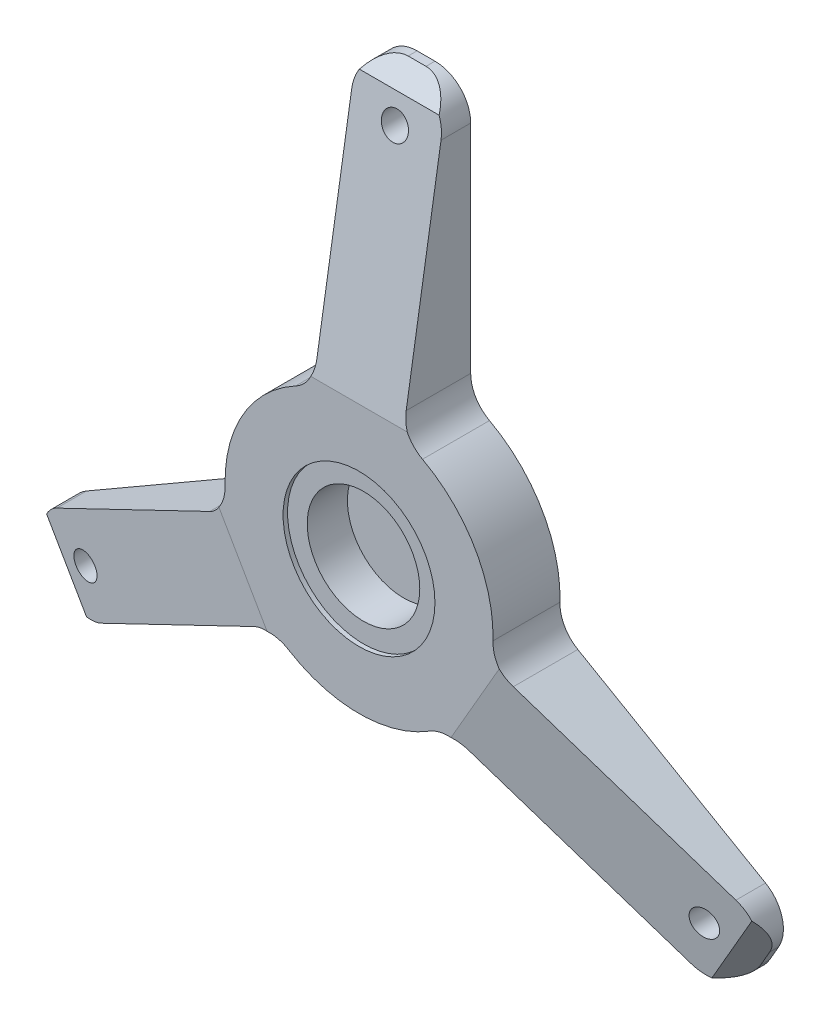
ISO-10303-21;
HEADER;
FILE_DESCRIPTION(('STEP AP214'),'2;1');
FILE_NAME('part.step','',(''),(''),'','','');
FILE_SCHEMA(('AUTOMOTIVE_DESIGN { 1 0 10303 214 1 1 1 1 }'));
ENDSEC;
DATA;
#1=APPLICATION_CONTEXT('core data for automotive mechanical design processes');
#2=APPLICATION_PROTOCOL_DEFINITION('international standard','automotive_design',2000,#1);
#3=PRODUCT_CONTEXT('',#1,'mechanical');
#4=PRODUCT('Part','Part','',(#3));
#5=PRODUCT_RELATED_PRODUCT_CATEGORY('part','',(#4));
#6=PRODUCT_DEFINITION_FORMATION('','',#4);
#7=PRODUCT_DEFINITION_CONTEXT('part definition',#1,'design');
#8=PRODUCT_DEFINITION('design','',#6,#7);
#9=PRODUCT_DEFINITION_SHAPE('','',#8);
#10=(LENGTH_UNIT() NAMED_UNIT(*) SI_UNIT(.MILLI.,.METRE.));
#11=(NAMED_UNIT(*) PLANE_ANGLE_UNIT() SI_UNIT($,.RADIAN.));
#12=(NAMED_UNIT(*) SI_UNIT($,.STERADIAN.) SOLID_ANGLE_UNIT());
#13=UNCERTAINTY_MEASURE_WITH_UNIT(LENGTH_MEASURE(1.E-05),#10,'distance_accuracy_value','');
#14=(GEOMETRIC_REPRESENTATION_CONTEXT(3) GLOBAL_UNCERTAINTY_ASSIGNED_CONTEXT((#13)) GLOBAL_UNIT_ASSIGNED_CONTEXT((#10,
#11,#12)) REPRESENTATION_CONTEXT('',''));
#15=CARTESIAN_POINT('',(0.,0.,0.));
#16=DIRECTION('',(0.,0.,1.));
#17=DIRECTION('',(1.,0.,0.));
#18=AXIS2_PLACEMENT_3D('',#15,#16,#17);
#19=CARTESIAN_POINT('',(0.,0.,15.));
#20=DIRECTION('',(0.,0.,-1.));
#21=DIRECTION('',(-1.,0.,0.));
#22=AXIS2_PLACEMENT_3D('',#19,#20,#21);
#23=CYLINDRICAL_SURFACE('',#22,30.);
#24=CARTESIAN_POINT('',(0.,0.,0.));
#25=DIRECTION('',(0.,0.,1.));
#26=DIRECTION('',(1.,0.,0.));
#27=AXIS2_PLACEMENT_3D('',#24,#25,#26);
#28=CIRCLE('',#27,30.);
#29=CARTESIAN_POINT('',(-15.775858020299,-25.5170982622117,0.));
#30=VERTEX_POINT('',#29);
#31=CARTESIAN_POINT('',(15.7758580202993,-25.5170982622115,0.));
#32=VERTEX_POINT('',#31);
#33=EDGE_CURVE('E232',#30,#32,#28,.T.);
#34=ORIENTED_EDGE('',*,*,#33,.T.);
#35=DIRECTION('',(0.,0.,-1.));
#36=VECTOR('',#35,1.);
#37=CARTESIAN_POINT('',(15.7758580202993,-25.5170982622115,15.));
#38=LINE('',#37,#36);
#39=CARTESIAN_POINT('',(15.7758580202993,-25.5170982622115,15.));
#40=VERTEX_POINT('',#39);
#41=EDGE_CURVE('E239',#32,#40,#38,.F.);
#42=ORIENTED_EDGE('',*,*,#41,.T.);
#43=CARTESIAN_POINT('',(0.,0.,15.));
#44=DIRECTION('',(0.,0.,1.));
#45=DIRECTION('',(1.,0.,0.));
#46=AXIS2_PLACEMENT_3D('',#43,#44,#45);
#47=CIRCLE('',#46,30.);
#48=CARTESIAN_POINT('',(-15.775858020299,-25.5170982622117,15.));
#49=VERTEX_POINT('',#48);
#50=EDGE_CURVE('E235',#49,#40,#47,.T.);
#51=ORIENTED_EDGE('',*,*,#50,.F.);
#52=DIRECTION('',(0.,0.,-1.));
#53=VECTOR('',#52,1.);
#54=CARTESIAN_POINT('',(-15.775858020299,-25.5170982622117,15.));
#55=LINE('',#54,#53);
#56=EDGE_CURVE('E229',#49,#30,#55,.T.);
#57=ORIENTED_EDGE('',*,*,#56,.T.);
#58=EDGE_LOOP('',(#34,#42,#51,#57));
#59=FACE_BOUND('',#58,.T.);
#60=ADVANCED_FACE('F35',(#59),#23,.T.);
#61=CARTESIAN_POINT('',(29.9863843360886,-0.903744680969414,15.));
#62=VERTEX_POINT('',#61);
#63=CARTESIAN_POINT('',(14.2105263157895,26.4208429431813,15.));
#64=VERTEX_POINT('',#63);
#65=EDGE_CURVE('E305',#62,#64,#47,.T.);
#66=ORIENTED_EDGE('',*,*,#65,.F.);
#67=DIRECTION('',(0.,0.,-1.));
#68=VECTOR('',#67,1.);
#69=CARTESIAN_POINT('',(29.9863843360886,-0.903744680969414,15.));
#70=LINE('',#69,#68);
#71=CARTESIAN_POINT('',(29.9863843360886,-0.903744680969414,0.));
#72=VERTEX_POINT('',#71);
#73=EDGE_CURVE('E371',#62,#72,#70,.T.);
#74=ORIENTED_EDGE('',*,*,#73,.T.);
#75=CARTESIAN_POINT('',(14.2105263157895,26.4208429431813,0.));
#76=VERTEX_POINT('',#75);
#77=EDGE_CURVE('E252',#72,#76,#28,.T.);
#78=ORIENTED_EDGE('',*,*,#77,.T.);
#79=DIRECTION('',(0.,0.,-1.));
#80=VECTOR('',#79,1.);
#81=CARTESIAN_POINT('',(14.2105263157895,26.4208429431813,15.));
#82=LINE('',#81,#80);
#83=EDGE_CURVE('E368',#76,#64,#82,.F.);
#84=ORIENTED_EDGE('',*,*,#83,.T.);
#85=EDGE_LOOP('',(#66,#74,#78,#84));
#86=FACE_BOUND('',#85,.T.);
#87=ADVANCED_FACE('F491',(#86),#23,.T.);
#88=CARTESIAN_POINT('',(-14.2105263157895,26.4208429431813,15.));
#89=VERTEX_POINT('',#88);
#90=CARTESIAN_POINT('',(-29.9863843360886,-0.903744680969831,15.));
#91=VERTEX_POINT('',#90);
#92=EDGE_CURVE('E240',#89,#91,#47,.T.);
#93=ORIENTED_EDGE('',*,*,#92,.F.);
#94=DIRECTION('',(0.,0.,-1.));
#95=VECTOR('',#94,1.);
#96=CARTESIAN_POINT('',(-14.2105263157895,26.4208429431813,15.));
#97=LINE('',#96,#95);
#98=CARTESIAN_POINT('',(-14.2105263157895,26.4208429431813,0.));
#99=VERTEX_POINT('',#98);
#100=EDGE_CURVE('E399',#89,#99,#97,.T.);
#101=ORIENTED_EDGE('',*,*,#100,.T.);
#102=CARTESIAN_POINT('',(-29.9863843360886,-0.903744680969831,0.));
#103=VERTEX_POINT('',#102);
#104=EDGE_CURVE('E251',#99,#103,#28,.T.);
#105=ORIENTED_EDGE('',*,*,#104,.T.);
#106=DIRECTION('',(0.,0.,-1.));
#107=VECTOR('',#106,1.);
#108=CARTESIAN_POINT('',(-29.9863843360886,-0.903744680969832,15.));
#109=LINE('',#108,#107);
#110=EDGE_CURVE('E396',#103,#91,#109,.F.);
#111=ORIENTED_EDGE('',*,*,#110,.T.);
#112=EDGE_LOOP('',(#93,#101,#105,#111));
#113=FACE_BOUND('',#112,.T.);
#114=ADVANCED_FACE('F558',(#113),#23,.T.);
#115=CARTESIAN_POINT('',(0.,0.,15.));
#116=DIRECTION('',(0.,0.,1.));
#117=DIRECTION('',(1.,0.,0.));
#118=AXIS2_PLACEMENT_3D('',#115,#116,#117);
#119=PLANE('',#118);
#120=CARTESIAN_POINT('',(0.,0.,15.));
#121=DIRECTION('',(0.,0.,1.));
#122=DIRECTION('',(1.,0.,0.));
#123=AXIS2_PLACEMENT_3D('',#120,#121,#122);
#124=CIRCLE('',#123,17.);
#125=CARTESIAN_POINT('',(17.,0.,15.));
#126=VERTEX_POINT('',#125);
#127=EDGE_CURVE('E329',#126,#126,#124,.T.);
#128=ORIENTED_EDGE('',*,*,#127,.F.);
#129=EDGE_LOOP('',(#128));
#130=FACE_BOUND('',#129,.T.);
#131=DIRECTION('',(-1.,0.,0.));
#132=VECTOR('',#131,1.);
#133=CARTESIAN_POINT('',(10.,30.,15.));
#134=LINE('',#133,#132);
#135=CARTESIAN_POINT('',(10.7900025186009,30.,15.));
#136=VERTEX_POINT('',#135);
#137=CARTESIAN_POINT('',(-10.7900025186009,30.,15.));
#138=VERTEX_POINT('',#137);
#139=EDGE_CURVE('E446',#136,#138,#134,.T.);
#140=ORIENTED_EDGE('',*,*,#139,.T.);
#141=CARTESIAN_POINT('',(-18.,33.466401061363,15.));
#142=DIRECTION('',(0.,0.,1.));
#143=DIRECTION('',(1.,0.,0.));
#144=AXIS2_PLACEMENT_3D('',#141,#142,#143);
#145=CIRCLE('',#144,8.);
#146=EDGE_CURVE('E293',#138,#89,#145,.F.);
#147=ORIENTED_EDGE('',*,*,#146,.T.);
#148=ORIENTED_EDGE('',*,*,#92,.T.);
#149=CARTESIAN_POINT('',(-37.9827534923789,-1.14474326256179,15.));
#150=DIRECTION('',(0.,0.,1.));
#151=DIRECTION('',(1.,0.,0.));
#152=AXIS2_PLACEMENT_3D('',#149,#150,#151);
#153=CIRCLE('',#152,8.);
#154=CARTESIAN_POINT('',(-31.3757633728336,-5.65558371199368,15.));
#155=VERTEX_POINT('',#154);
#156=EDGE_CURVE('E297',#91,#155,#153,.F.);
#157=ORIENTED_EDGE('',*,*,#156,.T.);
#158=DIRECTION('',(0.500000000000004,-0.866025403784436,0.));
#159=VECTOR('',#158,1.);
#160=CARTESIAN_POINT('',(-30.9807621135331,-6.33974596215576,15.));
#161=LINE('',#160,#159);
#162=CARTESIAN_POINT('',(-20.5857608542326,-24.3444162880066,15.));
#163=VERTEX_POINT('',#162);
#164=EDGE_CURVE('E50',#155,#163,#161,.T.);
#165=ORIENTED_EDGE('',*,*,#164,.T.);
#166=CARTESIAN_POINT('',(-19.9827534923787,-32.3216577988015,15.));
#167=DIRECTION('',(0.,0.,1.));
#168=DIRECTION('',(1.,0.,0.));
#169=AXIS2_PLACEMENT_3D('',#166,#167,#168);
#170=CIRCLE('',#169,8.);
#171=EDGE_CURVE('E43',#163,#49,#170,.F.);
#172=ORIENTED_EDGE('',*,*,#171,.T.);
#173=ORIENTED_EDGE('',*,*,#50,.T.);
#174=CARTESIAN_POINT('',(19.9827534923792,-32.3216577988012,15.));
#175=DIRECTION('',(0.,0.,1.));
#176=DIRECTION('',(1.,0.,0.));
#177=AXIS2_PLACEMENT_3D('',#174,#175,#176);
#178=CIRCLE('',#177,8.);
#179=CARTESIAN_POINT('',(20.5857608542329,-24.3444162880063,15.));
#180=VERTEX_POINT('',#179);
#181=EDGE_CURVE('E265',#40,#180,#178,.F.);
#182=ORIENTED_EDGE('',*,*,#181,.T.);
#183=DIRECTION('',(0.499999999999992,0.866025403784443,0.));
#184=VECTOR('',#183,1.);
#185=CARTESIAN_POINT('',(20.9807621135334,-23.6602540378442,15.));
#186=LINE('',#185,#184);
#187=CARTESIAN_POINT('',(31.3757633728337,-5.65558371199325,15.));
#188=VERTEX_POINT('',#187);
#189=EDGE_CURVE('E494',#180,#188,#186,.T.);
#190=ORIENTED_EDGE('',*,*,#189,.T.);
#191=CARTESIAN_POINT('',(37.9827534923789,-1.14474326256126,15.));
#192=DIRECTION('',(0.,0.,1.));
#193=DIRECTION('',(1.,0.,0.));
#194=AXIS2_PLACEMENT_3D('',#191,#192,#193);
#195=CIRCLE('',#194,8.);
#196=EDGE_CURVE('E279',#188,#62,#195,.F.);
#197=ORIENTED_EDGE('',*,*,#196,.T.);
#198=ORIENTED_EDGE('',*,*,#65,.T.);
#199=CARTESIAN_POINT('',(18.,33.466401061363,15.));
#200=DIRECTION('',(0.,0.,1.));
#201=DIRECTION('',(1.,0.,0.));
#202=AXIS2_PLACEMENT_3D('',#199,#200,#201);
#203=CIRCLE('',#202,8.);
#204=EDGE_CURVE('E283',#64,#136,#203,.F.);
#205=ORIENTED_EDGE('',*,*,#204,.T.);
#206=EDGE_LOOP('',(#140,#147,#148,#157,#165,#172,#173,#182,#190,#197,#198,#205));
#207=FACE_BOUND('',#206,.T.);
#208=ADVANCED_FACE('F303',(#130,#207),#119,.T.);
#209=CARTESIAN_POINT('',(0.,0.,0.));
#210=DIRECTION('',(0.,0.,1.));
#211=DIRECTION('',(1.,0.,0.));
#212=AXIS2_PLACEMENT_3D('',#209,#210,#211);
#213=PLANE('',#212);
#214=CARTESIAN_POINT('',(-69.2820323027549,-40.0000000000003,0.));
#215=DIRECTION('',(0.,0.,-1.));
#216=DIRECTION('',(0.500000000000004,-0.866025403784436,0.));
#217=AXIS2_PLACEMENT_3D('',#214,#215,#216);
#218=CIRCLE('',#217,3.);
#219=CARTESIAN_POINT('',(-67.7820323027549,-42.5980762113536,0.));
#220=VERTEX_POINT('',#219);
#221=EDGE_CURVE('E323',#220,#220,#218,.T.);
#222=ORIENTED_EDGE('',*,*,#221,.F.);
#223=EDGE_LOOP('',(#222));
#224=FACE_BOUND('',#223,.T.);
#225=CARTESIAN_POINT('',(69.2820323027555,-39.9999999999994,0.));
#226=DIRECTION('',(0.,0.,-1.));
#227=DIRECTION('',(0.499999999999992,0.866025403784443,0.));
#228=AXIS2_PLACEMENT_3D('',#225,#226,#227);
#229=CIRCLE('',#228,3.);
#230=CARTESIAN_POINT('',(70.7820323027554,-37.401923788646,0.));
#231=VERTEX_POINT('',#230);
#232=EDGE_CURVE('E675',#231,#231,#229,.T.);
#233=ORIENTED_EDGE('',*,*,#232,.F.);
#234=EDGE_LOOP('',(#233));
#235=FACE_BOUND('',#234,.T.);
#236=DIRECTION('',(0.499999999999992,0.866025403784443,0.));
#237=VECTOR('',#236,1.);
#238=CARTESIAN_POINT('',(72.9422863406,-53.6602540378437,0.));
#239=LINE('',#238,#237);
#240=CARTESIAN_POINT('',(76.9422863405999,-46.7320508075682,0.));
#241=VERTEX_POINT('',#240);
#242=CARTESIAN_POINT('',(78.9422863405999,-43.2679491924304,0.));
#243=VERTEX_POINT('',#242);
#244=EDGE_CURVE('E522',#241,#243,#239,.T.);
#245=ORIENTED_EDGE('',*,*,#244,.F.);
#246=CARTESIAN_POINT('',(70.0140831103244,-42.7320508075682,0.));
#247=DIRECTION('',(0.,0.,1.));
#248=DIRECTION('',(1.,0.,0.));
#249=AXIS2_PLACEMENT_3D('',#246,#247,#248);
#250=CIRCLE('',#249,8.);
#251=CARTESIAN_POINT('',(66.0140831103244,-49.6602540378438,0.));
#252=VERTEX_POINT('',#251);
#253=EDGE_CURVE('E361',#241,#252,#250,.F.);
#254=ORIENTED_EDGE('',*,*,#253,.T.);
#255=DIRECTION('',(0.866025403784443,-0.499999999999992,0.));
#256=VECTOR('',#255,1.);
#257=CARTESIAN_POINT('',(-4.99999999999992,-8.66025403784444,0.));
#258=LINE('',#257,#256);
#259=CARTESIAN_POINT('',(23.9827534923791,-25.3934545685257,0.));
#260=VERTEX_POINT('',#259);
#261=EDGE_CURVE('E509',#260,#252,#258,.T.);
#262=ORIENTED_EDGE('',*,*,#261,.F.);
#263=CARTESIAN_POINT('',(19.9827534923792,-32.3216577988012,0.));
#264=DIRECTION('',(0.,0.,1.));
#265=DIRECTION('',(1.,0.,0.));
#266=AXIS2_PLACEMENT_3D('',#263,#264,#265);
#267=CIRCLE('',#266,8.);
#268=EDGE_CURVE('E250',#260,#32,#267,.T.);
#269=ORIENTED_EDGE('',*,*,#268,.T.);
#270=ORIENTED_EDGE('',*,*,#33,.F.);
#271=CARTESIAN_POINT('',(-19.9827534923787,-32.3216577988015,0.));
#272=DIRECTION('',(0.,0.,1.));
#273=DIRECTION('',(1.,0.,0.));
#274=AXIS2_PLACEMENT_3D('',#271,#272,#273);
#275=CIRCLE('',#274,8.);
#276=CARTESIAN_POINT('',(-23.9827534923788,-25.393454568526,0.));
#277=VERTEX_POINT('',#276);
#278=EDGE_CURVE('E11',#30,#277,#275,.T.);
#279=ORIENTED_EDGE('',*,*,#278,.T.);
#280=DIRECTION('',(-0.866025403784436,-0.500000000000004,0.));
#281=VECTOR('',#280,1.);
#282=CARTESIAN_POINT('',(5.00000000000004,-8.66025403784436,0.));
#283=LINE('',#282,#281);
#284=CARTESIAN_POINT('',(-66.0140831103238,-49.6602540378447,0.));
#285=VERTEX_POINT('',#284);
#286=EDGE_CURVE('E525',#277,#285,#283,.T.);
#287=ORIENTED_EDGE('',*,*,#286,.T.);
#288=CARTESIAN_POINT('',(-70.0140831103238,-42.7320508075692,0.));
#289=DIRECTION('',(0.,0.,1.));
#290=DIRECTION('',(1.,0.,0.));
#291=AXIS2_PLACEMENT_3D('',#288,#289,#290);
#292=CIRCLE('',#291,8.);
#293=CARTESIAN_POINT('',(-76.9422863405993,-46.7320508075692,0.));
#294=VERTEX_POINT('',#293);
#295=EDGE_CURVE('E353',#285,#294,#292,.F.);
#296=ORIENTED_EDGE('',*,*,#295,.T.);
#297=DIRECTION('',(0.500000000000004,-0.866025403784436,0.));
#298=VECTOR('',#297,1.);
#299=CARTESIAN_POINT('',(-82.9422863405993,-36.339745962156,0.));
#300=LINE('',#299,#298);
#301=CARTESIAN_POINT('',(-78.9422863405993,-43.2679491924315,0.));
#302=VERTEX_POINT('',#301);
#303=EDGE_CURVE('E423',#302,#294,#300,.T.);
#304=ORIENTED_EDGE('',*,*,#303,.F.);
#305=CARTESIAN_POINT('',(-72.0140831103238,-39.2679491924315,0.));
#306=DIRECTION('',(0.,0.,1.));
#307=DIRECTION('',(1.,0.,0.));
#308=AXIS2_PLACEMENT_3D('',#305,#306,#307);
#309=CIRCLE('',#308,8.);
#310=CARTESIAN_POINT('',(-76.0140831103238,-32.339745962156,0.));
#311=VERTEX_POINT('',#310);
#312=EDGE_CURVE('E355',#302,#311,#309,.F.);
#313=ORIENTED_EDGE('',*,*,#312,.T.);
#314=DIRECTION('',(-0.866025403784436,-0.500000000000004,0.));
#315=VECTOR('',#314,1.);
#316=CARTESIAN_POINT('',(-5.00000000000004,8.66025403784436,0.));
#317=LINE('',#316,#315);
#318=CARTESIAN_POINT('',(-33.9827534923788,-8.07294649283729,0.));
#319=VERTEX_POINT('',#318);
#320=EDGE_CURVE('E526',#319,#311,#317,.T.);
#321=ORIENTED_EDGE('',*,*,#320,.F.);
#322=CARTESIAN_POINT('',(-37.9827534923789,-1.14474326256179,0.));
#323=DIRECTION('',(0.,0.,1.));
#324=DIRECTION('',(1.,0.,0.));
#325=AXIS2_PLACEMENT_3D('',#322,#323,#324);
#326=CIRCLE('',#325,8.);
#327=EDGE_CURVE('E301',#319,#103,#326,.T.);
#328=ORIENTED_EDGE('',*,*,#327,.T.);
#329=ORIENTED_EDGE('',*,*,#104,.F.);
#330=CARTESIAN_POINT('',(-18.,33.466401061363,0.));
#331=DIRECTION('',(0.,0.,1.));
#332=DIRECTION('',(1.,0.,0.));
#333=AXIS2_PLACEMENT_3D('',#330,#331,#332);
#334=CIRCLE('',#333,8.);
#335=CARTESIAN_POINT('',(-10.,33.466401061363,0.));
#336=VERTEX_POINT('',#335);
#337=EDGE_CURVE('E295',#99,#336,#334,.T.);
#338=ORIENTED_EDGE('',*,*,#337,.T.);
#339=DIRECTION('',(0.,1.,0.));
#340=VECTOR('',#339,1.);
#341=CARTESIAN_POINT('',(-10.,0.,0.));
#342=LINE('',#341,#340);
#343=CARTESIAN_POINT('',(-10.,82.,0.));
#344=VERTEX_POINT('',#343);
#345=EDGE_CURVE('E317',#336,#344,#342,.T.);
#346=ORIENTED_EDGE('',*,*,#345,.T.);
#347=CARTESIAN_POINT('',(-2.,82.,0.));
#348=DIRECTION('',(0.,0.,1.));
#349=DIRECTION('',(1.,0.,0.));
#350=AXIS2_PLACEMENT_3D('',#347,#348,#349);
#351=CIRCLE('',#350,8.);
#352=CARTESIAN_POINT('',(-2.,90.,0.));
#353=VERTEX_POINT('',#352);
#354=EDGE_CURVE('E357',#344,#353,#351,.F.);
#355=ORIENTED_EDGE('',*,*,#354,.T.);
#356=DIRECTION('',(-1.,0.,0.));
#357=VECTOR('',#356,1.);
#358=CARTESIAN_POINT('',(10.,90.,0.));
#359=LINE('',#358,#357);
#360=CARTESIAN_POINT('',(2.,90.,0.));
#361=VERTEX_POINT('',#360);
#362=EDGE_CURVE('E310',#361,#353,#359,.T.);
#363=ORIENTED_EDGE('',*,*,#362,.F.);
#364=CARTESIAN_POINT('',(2.,82.,0.));
#365=DIRECTION('',(0.,0.,1.));
#366=DIRECTION('',(1.,0.,0.));
#367=AXIS2_PLACEMENT_3D('',#364,#365,#366);
#368=CIRCLE('',#367,8.);
#369=CARTESIAN_POINT('',(10.,82.,0.));
#370=VERTEX_POINT('',#369);
#371=EDGE_CURVE('E351',#361,#370,#368,.F.);
#372=ORIENTED_EDGE('',*,*,#371,.T.);
#373=DIRECTION('',(0.,1.,0.));
#374=VECTOR('',#373,1.);
#375=CARTESIAN_POINT('',(10.,0.,0.));
#376=LINE('',#375,#374);
#377=CARTESIAN_POINT('',(10.,33.466401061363,0.));
#378=VERTEX_POINT('',#377);
#379=EDGE_CURVE('E439',#378,#370,#376,.T.);
#380=ORIENTED_EDGE('',*,*,#379,.F.);
#381=CARTESIAN_POINT('',(18.,33.466401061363,0.));
#382=DIRECTION('',(0.,0.,1.));
#383=DIRECTION('',(1.,0.,0.));
#384=AXIS2_PLACEMENT_3D('',#381,#382,#383);
#385=CIRCLE('',#384,8.);
#386=EDGE_CURVE('E288',#378,#76,#385,.T.);
#387=ORIENTED_EDGE('',*,*,#386,.T.);
#388=ORIENTED_EDGE('',*,*,#77,.F.);
#389=CARTESIAN_POINT('',(37.9827534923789,-1.14474326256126,0.));
#390=DIRECTION('',(0.,0.,1.));
#391=DIRECTION('',(1.,0.,0.));
#392=AXIS2_PLACEMENT_3D('',#389,#390,#391);
#393=CIRCLE('',#392,8.);
#394=CARTESIAN_POINT('',(33.9827534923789,-8.0729464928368,0.));
#395=VERTEX_POINT('',#394);
#396=EDGE_CURVE('E281',#72,#395,#393,.T.);
#397=ORIENTED_EDGE('',*,*,#396,.T.);
#398=DIRECTION('',(0.866025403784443,-0.499999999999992,0.));
#399=VECTOR('',#398,1.);
#400=CARTESIAN_POINT('',(4.99999999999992,8.66025403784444,0.));
#401=LINE('',#400,#399);
#402=CARTESIAN_POINT('',(76.0140831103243,-32.3397459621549,0.));
#403=VERTEX_POINT('',#402);
#404=EDGE_CURVE('E326',#395,#403,#401,.T.);
#405=ORIENTED_EDGE('',*,*,#404,.T.);
#406=CARTESIAN_POINT('',(72.0140831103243,-39.2679491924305,0.));
#407=DIRECTION('',(0.,0.,1.));
#408=DIRECTION('',(1.,0.,0.));
#409=AXIS2_PLACEMENT_3D('',#406,#407,#408);
#410=CIRCLE('',#409,8.);
#411=EDGE_CURVE('E359',#403,#243,#410,.F.);
#412=ORIENTED_EDGE('',*,*,#411,.T.);
#413=EDGE_LOOP('',(#245,#254,#262,#269,#270,#279,#287,#296,#304,#313,#321,#328,#329,#338,#346,
#355,#363,#372,#380,#387,#388,#397,#405,#412));
#414=FACE_BOUND('',#413,.T.);
#415=CARTESIAN_POINT('',(0.,80.,0.));
#416=DIRECTION('',(0.,0.,-1.));
#417=DIRECTION('',(-1.,0.,0.));
#418=AXIS2_PLACEMENT_3D('',#415,#416,#417);
#419=CIRCLE('',#418,3.);
#420=CARTESIAN_POINT('',(-3.,80.,0.));
#421=VERTEX_POINT('',#420);
#422=EDGE_CURVE('E318',#421,#421,#419,.T.);
#423=ORIENTED_EDGE('',*,*,#422,.F.);
#424=EDGE_LOOP('',(#423));
#425=FACE_BOUND('',#424,.T.);
#426=ADVANCED_FACE('F244',(#224,#235,#414,#425),#213,.F.);
#427=CARTESIAN_POINT('',(10.,0.,0.));
#428=DIRECTION('',(1.,0.,0.));
#429=DIRECTION('',(0.,0.,-1.));
#430=AXIS2_PLACEMENT_3D('',#427,#428,#429);
#431=PLANE('',#430);
#432=DIRECTION('',(0.,-0.987330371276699,0.158678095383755));
#433=VECTOR('',#432,1.);
#434=CARTESIAN_POINT('',(10.,86.,6.));
#435=LINE('',#434,#433);
#436=CARTESIAN_POINT('',(10.,82.,6.64285714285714));
#437=VERTEX_POINT('',#436);
#438=CARTESIAN_POINT('',(10.,33.466401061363,14.4428998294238));
#439=VERTEX_POINT('',#438);
#440=EDGE_CURVE('E442',#437,#439,#435,.T.);
#441=ORIENTED_EDGE('',*,*,#440,.T.);
#442=DIRECTION('',(0.,0.,-1.));
#443=VECTOR('',#442,1.);
#444=CARTESIAN_POINT('',(10.,33.466401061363,0.));
#445=LINE('',#444,#443);
#446=EDGE_CURVE('E376',#439,#378,#445,.T.);
#447=ORIENTED_EDGE('',*,*,#446,.T.);
#448=ORIENTED_EDGE('',*,*,#379,.T.);
#449=DIRECTION('',(0.,0.,1.));
#450=VECTOR('',#449,1.);
#451=CARTESIAN_POINT('',(10.,82.,2.));
#452=LINE('',#451,#450);
#453=EDGE_CURVE('E373',#370,#437,#452,.T.);
#454=ORIENTED_EDGE('',*,*,#453,.T.);
#455=EDGE_LOOP('',(#441,#447,#448,#454));
#456=FACE_BOUND('',#455,.T.);
#457=ADVANCED_FACE('F480',(#456),#431,.T.);
#458=CARTESIAN_POINT('',(-10.,0.,0.));
#459=DIRECTION('',(1.,0.,0.));
#460=DIRECTION('',(0.,0.,-1.));
#461=AXIS2_PLACEMENT_3D('',#458,#459,#460);
#462=PLANE('',#461);
#463=DIRECTION('',(0.,-0.987330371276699,0.158678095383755));
#464=VECTOR('',#463,1.);
#465=CARTESIAN_POINT('',(-10.,86.,6.));
#466=LINE('',#465,#464);
#467=CARTESIAN_POINT('',(-10.,82.,6.64285714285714));
#468=VERTEX_POINT('',#467);
#469=CARTESIAN_POINT('',(-10.,33.466401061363,14.4428998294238));
#470=VERTEX_POINT('',#469);
#471=EDGE_CURVE('E443',#468,#470,#466,.T.);
#472=ORIENTED_EDGE('',*,*,#471,.F.);
#473=DIRECTION('',(0.,0.,1.));
#474=VECTOR('',#473,1.);
#475=CARTESIAN_POINT('',(-10.,82.,0.));
#476=LINE('',#475,#474);
#477=EDGE_CURVE('E394',#468,#344,#476,.F.);
#478=ORIENTED_EDGE('',*,*,#477,.T.);
#479=ORIENTED_EDGE('',*,*,#345,.F.);
#480=DIRECTION('',(0.,0.,1.));
#481=VECTOR('',#480,1.);
#482=CARTESIAN_POINT('',(-10.,33.466401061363,15.));
#483=LINE('',#482,#481);
#484=EDGE_CURVE('E391',#336,#470,#483,.T.);
#485=ORIENTED_EDGE('',*,*,#484,.T.);
#486=EDGE_LOOP('',(#472,#478,#479,#485));
#487=FACE_BOUND('',#486,.T.);
#488=ADVANCED_FACE('F566',(#487),#462,.F.);
#489=CARTESIAN_POINT('',(10.,90.,0.));
#490=DIRECTION('',(0.,-1.,0.));
#491=DIRECTION('',(0.,0.,-1.));
#492=AXIS2_PLACEMENT_3D('',#489,#490,#491);
#493=PLANE('',#492);
#494=ORIENTED_EDGE('',*,*,#362,.T.);
#495=DIRECTION('',(0.,0.,1.));
#496=VECTOR('',#495,1.);
#497=CARTESIAN_POINT('',(-2.,90.,0.));
#498=LINE('',#497,#496);
#499=CARTESIAN_POINT('',(-2.,90.,2.));
#500=VERTEX_POINT('',#499);
#501=EDGE_CURVE('E380',#353,#500,#498,.T.);
#502=ORIENTED_EDGE('',*,*,#501,.T.);
#503=DIRECTION('',(-1.,0.,0.));
#504=VECTOR('',#503,1.);
#505=CARTESIAN_POINT('',(10.,90.,2.));
#506=LINE('',#505,#504);
#507=CARTESIAN_POINT('',(2.,90.,2.));
#508=VERTEX_POINT('',#507);
#509=EDGE_CURVE('E454',#508,#500,#506,.T.);
#510=ORIENTED_EDGE('',*,*,#509,.F.);
#511=DIRECTION('',(0.,0.,1.));
#512=VECTOR('',#511,1.);
#513=CARTESIAN_POINT('',(2.,90.,0.));
#514=LINE('',#513,#512);
#515=EDGE_CURVE('E378',#508,#361,#514,.F.);
#516=ORIENTED_EDGE('',*,*,#515,.T.);
#517=EDGE_LOOP('',(#494,#502,#510,#516));
#518=FACE_BOUND('',#517,.T.);
#519=ADVANCED_FACE('F462',(#518),#493,.F.);
#520=CARTESIAN_POINT('',(10.,90.,2.));
#521=DIRECTION('',(0.,-0.707106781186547,-0.707106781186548));
#522=DIRECTION('',(0.,0.707106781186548,-0.707106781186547));
#523=AXIS2_PLACEMENT_3D('',#520,#521,#522);
#524=PLANE('',#523);
#525=ORIENTED_EDGE('',*,*,#509,.T.);
#526=CARTESIAN_POINT('',(-2.,82.,10.));
#527=DIRECTION('',(0.,-0.707106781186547,-0.707106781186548));
#528=DIRECTION('',(0.,-0.707106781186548,0.707106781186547));
#529=AXIS2_PLACEMENT_3D('',#526,#527,#528);
#530=ELLIPSE('',#529,11.3137084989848,8.);
#531=CARTESIAN_POINT('',(-8.9282032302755,86.,6.));
#532=VERTEX_POINT('',#531);
#533=EDGE_CURVE('E385',#500,#532,#530,.F.);
#534=ORIENTED_EDGE('',*,*,#533,.T.);
#535=DIRECTION('',(-1.,0.,0.));
#536=VECTOR('',#535,1.);
#537=CARTESIAN_POINT('',(10.,86.,6.));
#538=LINE('',#537,#536);
#539=CARTESIAN_POINT('',(8.92820323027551,86.,6.));
#540=VERTEX_POINT('',#539);
#541=EDGE_CURVE('E452',#540,#532,#538,.T.);
#542=ORIENTED_EDGE('',*,*,#541,.F.);
#543=CARTESIAN_POINT('',(2.,82.,10.));
#544=DIRECTION('',(0.,-0.707106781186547,-0.707106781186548));
#545=DIRECTION('',(0.,0.707106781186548,-0.707106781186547));
#546=AXIS2_PLACEMENT_3D('',#543,#544,#545);
#547=ELLIPSE('',#546,11.3137084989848,8.);
#548=EDGE_CURVE('E383',#540,#508,#547,.F.);
#549=ORIENTED_EDGE('',*,*,#548,.T.);
#550=EDGE_LOOP('',(#525,#534,#542,#549));
#551=FACE_BOUND('',#550,.T.);
#552=ADVANCED_FACE('F471',(#551),#524,.F.);
#553=CARTESIAN_POINT('',(10.,86.,6.));
#554=DIRECTION('',(0.,-0.158678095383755,-0.987330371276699));
#555=DIRECTION('',(0.,0.987330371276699,-0.158678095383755));
#556=AXIS2_PLACEMENT_3D('',#553,#554,#555);
#557=PLANE('',#556);
#558=CARTESIAN_POINT('',(0.,80.,6.96428571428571));
#559=DIRECTION('',(0.,-0.158678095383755,-0.987330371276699));
#560=DIRECTION('',(0.,0.987330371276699,-0.158678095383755));
#561=AXIS2_PLACEMENT_3D('',#558,#559,#560);
#562=ELLIPSE('',#561,3.03849662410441,3.);
#563=CARTESIAN_POINT('',(0.,83.,6.48214285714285));
#564=VERTEX_POINT('',#563);
#565=EDGE_CURVE('E314',#564,#564,#562,.T.);
#566=ORIENTED_EDGE('',*,*,#565,.T.);
#567=EDGE_LOOP('',(#566));
#568=FACE_BOUND('',#567,.T.);
#569=ORIENTED_EDGE('',*,*,#541,.T.);
#570=CARTESIAN_POINT('',(-2.,82.,6.64285714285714));
#571=DIRECTION('',(0.,-0.158678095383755,-0.987330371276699));
#572=DIRECTION('',(0.,-0.987330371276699,0.158678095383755));
#573=AXIS2_PLACEMENT_3D('',#570,#571,#572);
#574=ELLIPSE('',#573,8.10265766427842,8.);
#575=EDGE_CURVE('E389',#532,#468,#574,.F.);
#576=ORIENTED_EDGE('',*,*,#575,.T.);
#577=ORIENTED_EDGE('',*,*,#471,.T.);
#578=CARTESIAN_POINT('',(-18.,33.466401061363,14.4428998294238));
#579=DIRECTION('',(0.,-0.158678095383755,-0.987330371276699));
#580=DIRECTION('',(0.,0.987330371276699,-0.158678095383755));
#581=AXIS2_PLACEMENT_3D('',#578,#579,#580);
#582=ELLIPSE('',#581,8.10265766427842,8.);
#583=EDGE_CURVE('E290',#470,#138,#582,.T.);
#584=ORIENTED_EDGE('',*,*,#583,.T.);
#585=ORIENTED_EDGE('',*,*,#139,.F.);
#586=CARTESIAN_POINT('',(18.,33.466401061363,14.4428998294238));
#587=DIRECTION('',(0.,-0.158678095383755,-0.987330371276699));
#588=DIRECTION('',(0.,0.987330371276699,-0.158678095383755));
#589=AXIS2_PLACEMENT_3D('',#586,#587,#588);
#590=ELLIPSE('',#589,8.10265766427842,8.);
#591=EDGE_CURVE('E286',#136,#439,#590,.T.);
#592=ORIENTED_EDGE('',*,*,#591,.T.);
#593=ORIENTED_EDGE('',*,*,#440,.F.);
#594=CARTESIAN_POINT('',(2.,82.,6.64285714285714));
#595=DIRECTION('',(0.,-0.158678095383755,-0.987330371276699));
#596=DIRECTION('',(0.,0.987330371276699,-0.158678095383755));
#597=AXIS2_PLACEMENT_3D('',#594,#595,#596);
#598=ELLIPSE('',#597,8.10265766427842,8.);
#599=EDGE_CURVE('E387',#437,#540,#598,.F.);
#600=ORIENTED_EDGE('',*,*,#599,.T.);
#601=EDGE_LOOP('',(#569,#576,#577,#584,#585,#592,#593,#600));
#602=FACE_BOUND('',#601,.T.);
#603=ADVANCED_FACE('F474',(#568,#602),#557,.F.);
#604=CARTESIAN_POINT('',(0.,80.,15.));
#605=DIRECTION('',(0.,0.,-1.));
#606=DIRECTION('',(-1.,0.,0.));
#607=AXIS2_PLACEMENT_3D('',#604,#605,#606);
#608=CYLINDRICAL_SURFACE('',#607,3.);
#609=ORIENTED_EDGE('',*,*,#422,.T.);
#610=EDGE_LOOP('',(#609));
#611=FACE_BOUND('',#610,.T.);
#612=ORIENTED_EDGE('',*,*,#565,.F.);
#613=EDGE_LOOP('',(#612));
#614=FACE_BOUND('',#613,.T.);
#615=ADVANCED_FACE('F597',(#611,#614),#608,.F.);
#616=CARTESIAN_POINT('',(72.9422863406,-53.6602540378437,0.));
#617=DIRECTION('',(-0.866025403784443,0.499999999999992,0.));
#618=DIRECTION('',(-0.499999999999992,-0.866025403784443,0.));
#619=AXIS2_PLACEMENT_3D('',#616,#617,#618);
#620=PLANE('',#619);
#621=DIRECTION('',(0.499999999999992,0.866025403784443,0.));
#622=VECTOR('',#621,1.);
#623=CARTESIAN_POINT('',(72.9422863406,-53.6602540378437,2.));
#624=LINE('',#623,#622);
#625=CARTESIAN_POINT('',(76.9422863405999,-46.7320508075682,2.));
#626=VERTEX_POINT('',#625);
#627=CARTESIAN_POINT('',(78.9422863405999,-43.2679491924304,2.));
#628=VERTEX_POINT('',#627);
#629=EDGE_CURVE('E519',#626,#628,#624,.T.);
#630=ORIENTED_EDGE('',*,*,#629,.F.);
#631=DIRECTION('',(0.,0.,1.));
#632=VECTOR('',#631,1.);
#633=CARTESIAN_POINT('',(76.9422863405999,-46.7320508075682,0.));
#634=LINE('',#633,#632);
#635=EDGE_CURVE('E349',#626,#241,#634,.F.);
#636=ORIENTED_EDGE('',*,*,#635,.T.);
#637=ORIENTED_EDGE('',*,*,#244,.T.);
#638=DIRECTION('',(0.,0.,1.));
#639=VECTOR('',#638,1.);
#640=CARTESIAN_POINT('',(78.9422863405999,-43.2679491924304,0.));
#641=LINE('',#640,#639);
#642=EDGE_CURVE('E346',#243,#628,#641,.T.);
#643=ORIENTED_EDGE('',*,*,#642,.T.);
#644=EDGE_LOOP('',(#630,#636,#637,#643));
#645=FACE_BOUND('',#644,.T.);
#646=ADVANCED_FACE('F602',(#645),#620,.F.);
#647=CARTESIAN_POINT('',(72.9422863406,-53.6602540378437,2.));
#648=DIRECTION('',(-0.612372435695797,0.353553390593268,-0.707106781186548));
#649=DIRECTION('',(-0.755928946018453,0.,0.654653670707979));
#650=AXIS2_PLACEMENT_3D('',#647,#648,#649);
#651=PLANE('',#650);
#652=DIRECTION('',(0.499999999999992,0.866025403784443,0.));
#653=VECTOR('',#652,1.);
#654=CARTESIAN_POINT('',(69.4781847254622,-51.6602540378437,6.));
#655=LINE('',#654,#653);
#656=CARTESIAN_POINT('',(70.0140831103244,-50.7320508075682,6.));
#657=VERTEX_POINT('',#656);
#658=CARTESIAN_POINT('',(78.9422863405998,-35.2679491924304,6.));
#659=VERTEX_POINT('',#658);
#660=EDGE_CURVE('E516',#657,#659,#655,.T.);
#661=ORIENTED_EDGE('',*,*,#660,.F.);
#662=CARTESIAN_POINT('',(70.0140831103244,-42.7320508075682,9.99999999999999));
#663=DIRECTION('',(-0.612372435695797,0.353553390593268,-0.707106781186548));
#664=DIRECTION('',(0.612372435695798,-0.353553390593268,-0.707106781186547));
#665=AXIS2_PLACEMENT_3D('',#662,#663,#664);
#666=ELLIPSE('',#665,11.3137084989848,8.);
#667=EDGE_CURVE('E344',#657,#626,#666,.F.);
#668=ORIENTED_EDGE('',*,*,#667,.T.);
#669=ORIENTED_EDGE('',*,*,#629,.T.);
#670=CARTESIAN_POINT('',(72.0140831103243,-39.2679491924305,9.99999999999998));
#671=DIRECTION('',(-0.612372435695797,0.353553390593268,-0.707106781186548));
#672=DIRECTION('',(-0.612372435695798,0.353553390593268,0.707106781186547));
#673=AXIS2_PLACEMENT_3D('',#670,#671,#672);
#674=ELLIPSE('',#673,11.3137084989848,8.);
#675=EDGE_CURVE('E342',#628,#659,#674,.F.);
#676=ORIENTED_EDGE('',*,*,#675,.T.);
#677=EDGE_LOOP('',(#661,#668,#669,#676));
#678=FACE_BOUND('',#677,.T.);
#679=ADVANCED_FACE('F610',(#678),#651,.F.);
#680=CARTESIAN_POINT('',(69.4781847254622,-51.6602540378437,6.));
#681=DIRECTION('',(-0.137419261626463,0.0793390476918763,-0.987330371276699));
#682=DIRECTION('',(-0.990452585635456,0.,0.137853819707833));
#683=AXIS2_PLACEMENT_3D('',#680,#681,#682);
#684=PLANE('',#683);
#685=CARTESIAN_POINT('',(69.2820323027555,-39.9999999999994,6.96428571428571));
#686=DIRECTION('',(-0.137419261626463,0.0793390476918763,-0.987330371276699));
#687=DIRECTION('',(0.855053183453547,-0.493665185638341,-0.158678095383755));
#688=AXIS2_PLACEMENT_3D('',#685,#686,#687);
#689=ELLIPSE('',#688,3.03849662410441,3.);
#690=CARTESIAN_POINT('',(71.8801085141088,-41.4999999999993,6.48214285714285));
#691=VERTEX_POINT('',#690);
#692=EDGE_CURVE('E322',#691,#691,#689,.T.);
#693=ORIENTED_EDGE('',*,*,#692,.T.);
#694=EDGE_LOOP('',(#693));
#695=FACE_BOUND('',#694,.T.);
#696=DIRECTION('',(-0.855053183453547,0.493665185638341,0.158678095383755));
#697=VECTOR('',#696,1.);
#698=CARTESIAN_POINT('',(69.4781847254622,-51.6602540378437,6.));
#699=LINE('',#698,#697);
#700=CARTESIAN_POINT('',(66.0140831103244,-49.6602540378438,6.64285714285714));
#701=VERTEX_POINT('',#700);
#702=CARTESIAN_POINT('',(23.9827534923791,-25.3934545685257,14.4428998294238));
#703=VERTEX_POINT('',#702);
#704=EDGE_CURVE('E512',#701,#703,#699,.T.);
#705=ORIENTED_EDGE('',*,*,#704,.F.);
#706=CARTESIAN_POINT('',(70.0140831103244,-42.7320508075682,6.64285714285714));
#707=DIRECTION('',(-0.137419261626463,0.0793390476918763,-0.987330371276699));
#708=DIRECTION('',(0.855053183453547,-0.493665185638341,-0.158678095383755));
#709=AXIS2_PLACEMENT_3D('',#706,#707,#708);
#710=ELLIPSE('',#709,8.10265766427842,8.);
#711=EDGE_CURVE('E340',#701,#657,#710,.F.);
#712=ORIENTED_EDGE('',*,*,#711,.T.);
#713=ORIENTED_EDGE('',*,*,#660,.T.);
#714=CARTESIAN_POINT('',(72.0140831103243,-39.2679491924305,6.64285714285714));
#715=DIRECTION('',(-0.137419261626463,0.0793390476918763,-0.987330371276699));
#716=DIRECTION('',(-0.855053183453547,0.493665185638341,0.158678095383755));
#717=AXIS2_PLACEMENT_3D('',#714,#715,#716);
#718=ELLIPSE('',#717,8.10265766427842,8.);
#719=CARTESIAN_POINT('',(76.0140831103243,-32.3397459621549,6.64285714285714));
#720=VERTEX_POINT('',#719);
#721=EDGE_CURVE('E338',#659,#720,#718,.F.);
#722=ORIENTED_EDGE('',*,*,#721,.T.);
#723=DIRECTION('',(-0.855053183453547,0.493665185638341,0.158678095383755));
#724=VECTOR('',#723,1.);
#725=CARTESIAN_POINT('',(79.478184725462,-34.3397459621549,6.));
#726=LINE('',#725,#724);
#727=CARTESIAN_POINT('',(33.982753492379,-8.07294649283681,14.4428998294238));
#728=VERTEX_POINT('',#727);
#729=EDGE_CURVE('E507',#720,#728,#726,.T.);
#730=ORIENTED_EDGE('',*,*,#729,.T.);
#731=CARTESIAN_POINT('',(37.9827534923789,-1.14474326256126,14.4428998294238));
#732=DIRECTION('',(-0.137419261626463,0.0793390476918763,-0.987330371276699));
#733=DIRECTION('',(0.855053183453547,-0.493665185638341,-0.158678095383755));
#734=AXIS2_PLACEMENT_3D('',#731,#732,#733);
#735=ELLIPSE('',#734,8.10265766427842,8.);
#736=EDGE_CURVE('E276',#728,#188,#735,.T.);
#737=ORIENTED_EDGE('',*,*,#736,.T.);
#738=ORIENTED_EDGE('',*,*,#189,.F.);
#739=CARTESIAN_POINT('',(19.9827534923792,-32.3216577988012,14.4428998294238));
#740=DIRECTION('',(-0.137419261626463,0.0793390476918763,-0.987330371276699));
#741=DIRECTION('',(0.855053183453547,-0.493665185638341,-0.158678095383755));
#742=AXIS2_PLACEMENT_3D('',#739,#740,#741);
#743=ELLIPSE('',#742,8.10265766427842,8.);
#744=EDGE_CURVE('E273',#180,#703,#743,.T.);
#745=ORIENTED_EDGE('',*,*,#744,.T.);
#746=EDGE_LOOP('',(#705,#712,#713,#722,#730,#737,#738,#745));
#747=FACE_BOUND('',#746,.T.);
#748=ADVANCED_FACE('F629',(#695,#747),#684,.F.);
#749=CARTESIAN_POINT('',(4.99999999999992,8.66025403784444,0.));
#750=DIRECTION('',(-0.499999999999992,-0.866025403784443,0.));
#751=DIRECTION('',(0.,0.,-1.));
#752=AXIS2_PLACEMENT_3D('',#749,#750,#751);
#753=PLANE('',#752);
#754=ORIENTED_EDGE('',*,*,#729,.F.);
#755=DIRECTION('',(0.,0.,1.));
#756=VECTOR('',#755,1.);
#757=CARTESIAN_POINT('',(76.0140831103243,-32.3397459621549,0.));
#758=LINE('',#757,#756);
#759=EDGE_CURVE('E366',#720,#403,#758,.F.);
#760=ORIENTED_EDGE('',*,*,#759,.T.);
#761=ORIENTED_EDGE('',*,*,#404,.F.);
#762=DIRECTION('',(0.,0.,1.));
#763=VECTOR('',#762,1.);
#764=CARTESIAN_POINT('',(33.9827534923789,-8.0729464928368,15.));
#765=LINE('',#764,#763);
#766=EDGE_CURVE('E363',#395,#728,#765,.T.);
#767=ORIENTED_EDGE('',*,*,#766,.T.);
#768=EDGE_LOOP('',(#754,#760,#761,#767));
#769=FACE_BOUND('',#768,.T.);
#770=ADVANCED_FACE('F504',(#769),#753,.F.);
#771=CARTESIAN_POINT('',(-4.99999999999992,-8.66025403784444,0.));
#772=DIRECTION('',(-0.499999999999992,-0.866025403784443,0.));
#773=DIRECTION('',(0.,0.,-1.));
#774=AXIS2_PLACEMENT_3D('',#771,#772,#773);
#775=PLANE('',#774);
#776=ORIENTED_EDGE('',*,*,#704,.T.);
#777=DIRECTION('',(0.,0.,-1.));
#778=VECTOR('',#777,1.);
#779=CARTESIAN_POINT('',(23.9827534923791,-25.3934545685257,0.));
#780=LINE('',#779,#778);
#781=EDGE_CURVE('E336',#703,#260,#780,.T.);
#782=ORIENTED_EDGE('',*,*,#781,.T.);
#783=ORIENTED_EDGE('',*,*,#261,.T.);
#784=DIRECTION('',(0.,0.,1.));
#785=VECTOR('',#784,1.);
#786=CARTESIAN_POINT('',(66.0140831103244,-49.6602540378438,2.));
#787=LINE('',#786,#785);
#788=EDGE_CURVE('E333',#252,#701,#787,.T.);
#789=ORIENTED_EDGE('',*,*,#788,.T.);
#790=EDGE_LOOP('',(#776,#782,#783,#789));
#791=FACE_BOUND('',#790,.T.);
#792=ADVANCED_FACE('F625',(#791),#775,.T.);
#793=CARTESIAN_POINT('',(-5.00000000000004,8.66025403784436,0.));
#794=DIRECTION('',(-0.500000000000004,0.866025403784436,0.));
#795=DIRECTION('',(0.,0.,-1.));
#796=AXIS2_PLACEMENT_3D('',#793,#794,#795);
#797=PLANE('',#796);
#798=DIRECTION('',(0.855053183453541,0.493665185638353,0.158678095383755));
#799=VECTOR('',#798,1.);
#800=CARTESIAN_POINT('',(-79.4781847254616,-34.339745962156,6.));
#801=LINE('',#800,#799);
#802=CARTESIAN_POINT('',(-76.0140831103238,-32.339745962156,6.64285714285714));
#803=VERTEX_POINT('',#802);
#804=CARTESIAN_POINT('',(-33.9827534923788,-8.07294649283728,14.4428998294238));
#805=VERTEX_POINT('',#804);
#806=EDGE_CURVE('E529',#803,#805,#801,.T.);
#807=ORIENTED_EDGE('',*,*,#806,.T.);
#808=DIRECTION('',(0.,0.,-1.));
#809=VECTOR('',#808,1.);
#810=CARTESIAN_POINT('',(-33.9827534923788,-8.07294649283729,0.));
#811=LINE('',#810,#809);
#812=EDGE_CURVE('E404',#805,#319,#811,.T.);
#813=ORIENTED_EDGE('',*,*,#812,.T.);
#814=ORIENTED_EDGE('',*,*,#320,.T.);
#815=DIRECTION('',(0.,0.,1.));
#816=VECTOR('',#815,1.);
#817=CARTESIAN_POINT('',(-76.0140831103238,-32.339745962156,2.));
#818=LINE('',#817,#816);
#819=EDGE_CURVE('E401',#311,#803,#818,.T.);
#820=ORIENTED_EDGE('',*,*,#819,.T.);
#821=EDGE_LOOP('',(#807,#813,#814,#820));
#822=FACE_BOUND('',#821,.T.);
#823=ADVANCED_FACE('F546',(#822),#797,.T.);
#824=CARTESIAN_POINT('',(5.00000000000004,-8.66025403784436,0.));
#825=DIRECTION('',(-0.500000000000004,0.866025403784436,0.));
#826=DIRECTION('',(0.,0.,-1.));
#827=AXIS2_PLACEMENT_3D('',#824,#825,#826);
#828=PLANE('',#827);
#829=DIRECTION('',(0.855053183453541,0.493665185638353,0.158678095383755));
#830=VECTOR('',#829,1.);
#831=CARTESIAN_POINT('',(-69.4781847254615,-51.6602540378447,6.));
#832=LINE('',#831,#830);
#833=CARTESIAN_POINT('',(-66.0140831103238,-49.6602540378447,6.64285714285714));
#834=VERTEX_POINT('',#833);
#835=CARTESIAN_POINT('',(-23.9827534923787,-25.393454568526,14.4428998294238));
#836=VERTEX_POINT('',#835);
#837=EDGE_CURVE('E530',#834,#836,#832,.T.);
#838=ORIENTED_EDGE('',*,*,#837,.F.);
#839=DIRECTION('',(0.,0.,1.));
#840=VECTOR('',#839,1.);
#841=CARTESIAN_POINT('',(-66.0140831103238,-49.6602540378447,0.));
#842=LINE('',#841,#840);
#843=EDGE_CURVE('E262',#834,#285,#842,.F.);
#844=ORIENTED_EDGE('',*,*,#843,.T.);
#845=ORIENTED_EDGE('',*,*,#286,.F.);
#846=DIRECTION('',(0.,0.,1.));
#847=VECTOR('',#846,1.);
#848=CARTESIAN_POINT('',(-23.9827534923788,-25.393454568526,15.));
#849=LINE('',#848,#847);
#850=EDGE_CURVE('E257',#277,#836,#849,.T.);
#851=ORIENTED_EDGE('',*,*,#850,.T.);
#852=EDGE_LOOP('',(#838,#844,#845,#851));
#853=FACE_BOUND('',#852,.T.);
#854=ADVANCED_FACE('F538',(#853),#828,.F.);
#855=CARTESIAN_POINT('',(-82.9422863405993,-36.339745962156,0.));
#856=DIRECTION('',(0.866025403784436,0.500000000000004,0.));
#857=DIRECTION('',(-0.500000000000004,0.866025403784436,0.));
#858=AXIS2_PLACEMENT_3D('',#855,#856,#857);
#859=PLANE('',#858);
#860=DIRECTION('',(0.500000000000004,-0.866025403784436,0.));
#861=VECTOR('',#860,1.);
#862=CARTESIAN_POINT('',(-82.9422863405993,-36.339745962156,2.));
#863=LINE('',#862,#861);
#864=CARTESIAN_POINT('',(-78.9422863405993,-43.2679491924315,2.));
#865=VERTEX_POINT('',#864);
#866=CARTESIAN_POINT('',(-76.9422863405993,-46.7320508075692,2.));
#867=VERTEX_POINT('',#866);
#868=EDGE_CURVE('E420',#865,#867,#863,.T.);
#869=ORIENTED_EDGE('',*,*,#868,.F.);
#870=DIRECTION('',(0.,0.,1.));
#871=VECTOR('',#870,1.);
#872=CARTESIAN_POINT('',(-78.9422863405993,-43.2679491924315,0.));
#873=LINE('',#872,#871);
#874=EDGE_CURVE('E263',#865,#302,#873,.F.);
#875=ORIENTED_EDGE('',*,*,#874,.T.);
#876=ORIENTED_EDGE('',*,*,#303,.T.);
#877=DIRECTION('',(0.,0.,1.));
#878=VECTOR('',#877,1.);
#879=CARTESIAN_POINT('',(-76.9422863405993,-46.7320508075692,0.));
#880=LINE('',#879,#878);
#881=EDGE_CURVE('E267',#294,#867,#880,.T.);
#882=ORIENTED_EDGE('',*,*,#881,.T.);
#883=EDGE_LOOP('',(#869,#875,#876,#882));
#884=FACE_BOUND('',#883,.T.);
#885=ADVANCED_FACE('F419',(#884),#859,.F.);
#886=CARTESIAN_POINT('',(-82.9422863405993,-36.339745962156,2.));
#887=DIRECTION('',(0.612372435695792,0.353553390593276,-0.707106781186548));
#888=DIRECTION('',(-0.755928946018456,0.,-0.654653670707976));
#889=AXIS2_PLACEMENT_3D('',#886,#887,#888);
#890=PLANE('',#889);
#891=DIRECTION('',(0.500000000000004,-0.866025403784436,0.));
#892=VECTOR('',#891,1.);
#893=CARTESIAN_POINT('',(-79.4781847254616,-34.339745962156,6.));
#894=LINE('',#893,#892);
#895=CARTESIAN_POINT('',(-78.9422863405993,-35.2679491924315,6.));
#896=VERTEX_POINT('',#895);
#897=CARTESIAN_POINT('',(-70.0140831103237,-50.7320508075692,6.));
#898=VERTEX_POINT('',#897);
#899=EDGE_CURVE('E431',#896,#898,#894,.T.);
#900=ORIENTED_EDGE('',*,*,#899,.F.);
#901=CARTESIAN_POINT('',(-72.0140831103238,-39.2679491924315,9.99999999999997));
#902=DIRECTION('',(0.612372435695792,0.353553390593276,-0.707106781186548));
#903=DIRECTION('',(-0.612372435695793,-0.353553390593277,-0.707106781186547));
#904=AXIS2_PLACEMENT_3D('',#901,#902,#903);
#905=ELLIPSE('',#904,11.3137084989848,8.);
#906=EDGE_CURVE('E412',#896,#865,#905,.F.);
#907=ORIENTED_EDGE('',*,*,#906,.T.);
#908=ORIENTED_EDGE('',*,*,#868,.T.);
#909=CARTESIAN_POINT('',(-70.0140831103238,-42.7320508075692,9.99999999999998));
#910=DIRECTION('',(0.612372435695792,0.353553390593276,-0.707106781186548));
#911=DIRECTION('',(0.612372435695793,0.353553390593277,0.707106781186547));
#912=AXIS2_PLACEMENT_3D('',#909,#910,#911);
#913=ELLIPSE('',#912,11.3137084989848,8.);
#914=EDGE_CURVE('E410',#867,#898,#913,.F.);
#915=ORIENTED_EDGE('',*,*,#914,.T.);
#916=EDGE_LOOP('',(#900,#907,#908,#915));
#917=FACE_BOUND('',#916,.T.);
#918=ADVANCED_FACE('F428',(#917),#890,.F.);
#919=CARTESIAN_POINT('',(-79.4781847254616,-34.339745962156,6.));
#920=DIRECTION('',(0.137419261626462,0.0793390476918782,-0.987330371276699));
#921=DIRECTION('',(-0.990452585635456,0.,-0.137853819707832));
#922=AXIS2_PLACEMENT_3D('',#919,#920,#921);
#923=PLANE('',#922);
#924=CARTESIAN_POINT('',(-69.2820323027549,-40.0000000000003,6.96428571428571));
#925=DIRECTION('',(0.137419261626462,0.0793390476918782,-0.987330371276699));
#926=DIRECTION('',(-0.855053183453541,-0.493665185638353,-0.158678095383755));
#927=AXIS2_PLACEMENT_3D('',#924,#925,#926);
#928=ELLIPSE('',#927,3.03849662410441,3.);
#929=CARTESIAN_POINT('',(-71.8801085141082,-41.5000000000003,6.48214285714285));
#930=VERTEX_POINT('',#929);
#931=EDGE_CURVE('E319',#930,#930,#928,.T.);
#932=ORIENTED_EDGE('',*,*,#931,.T.);
#933=EDGE_LOOP('',(#932));
#934=FACE_BOUND('',#933,.T.);
#935=ORIENTED_EDGE('',*,*,#806,.F.);
#936=CARTESIAN_POINT('',(-72.0140831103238,-39.2679491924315,6.64285714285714));
#937=DIRECTION('',(0.137419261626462,0.0793390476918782,-0.987330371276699));
#938=DIRECTION('',(-0.855053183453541,-0.493665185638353,-0.158678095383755));
#939=AXIS2_PLACEMENT_3D('',#936,#937,#938);
#940=ELLIPSE('',#939,8.10265766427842,8.);
#941=EDGE_CURVE('E408',#803,#896,#940,.F.);
#942=ORIENTED_EDGE('',*,*,#941,.T.);
#943=ORIENTED_EDGE('',*,*,#899,.T.);
#944=CARTESIAN_POINT('',(-70.0140831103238,-42.7320508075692,6.64285714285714));
#945=DIRECTION('',(0.137419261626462,0.0793390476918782,-0.987330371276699));
#946=DIRECTION('',(0.855053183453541,0.493665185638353,0.158678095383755));
#947=AXIS2_PLACEMENT_3D('',#944,#945,#946);
#948=ELLIPSE('',#947,8.10265766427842,8.);
#949=EDGE_CURVE('E406',#898,#834,#948,.F.);
#950=ORIENTED_EDGE('',*,*,#949,.T.);
#951=ORIENTED_EDGE('',*,*,#837,.T.);
#952=CARTESIAN_POINT('',(-19.9827534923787,-32.3216577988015,14.4428998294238));
#953=DIRECTION('',(0.137419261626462,0.0793390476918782,-0.987330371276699));
#954=DIRECTION('',(-0.855053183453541,-0.493665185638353,-0.158678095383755));
#955=AXIS2_PLACEMENT_3D('',#952,#953,#954);
#956=ELLIPSE('',#955,8.10265766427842,8.);
#957=EDGE_CURVE('E258',#836,#163,#956,.T.);
#958=ORIENTED_EDGE('',*,*,#957,.T.);
#959=ORIENTED_EDGE('',*,*,#164,.F.);
#960=CARTESIAN_POINT('',(-37.9827534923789,-1.14474326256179,14.4428998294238));
#961=DIRECTION('',(0.137419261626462,0.0793390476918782,-0.987330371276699));
#962=DIRECTION('',(-0.855053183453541,-0.493665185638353,-0.158678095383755));
#963=AXIS2_PLACEMENT_3D('',#960,#961,#962);
#964=ELLIPSE('',#963,8.10265766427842,8.);
#965=EDGE_CURVE('E299',#155,#805,#964,.T.);
#966=ORIENTED_EDGE('',*,*,#965,.T.);
#967=EDGE_LOOP('',(#935,#942,#943,#950,#951,#958,#959,#966));
#968=FACE_BOUND('',#967,.T.);
#969=ADVANCED_FACE('F535',(#934,#968),#923,.F.);
#970=CARTESIAN_POINT('',(-69.2820323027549,-40.0000000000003,15.));
#971=DIRECTION('',(0.,0.,-1.));
#972=DIRECTION('',(-1.,0.,0.));
#973=AXIS2_PLACEMENT_3D('',#970,#971,#972);
#974=CYLINDRICAL_SURFACE('',#973,3.);
#975=ORIENTED_EDGE('',*,*,#221,.T.);
#976=EDGE_LOOP('',(#975));
#977=FACE_BOUND('',#976,.T.);
#978=ORIENTED_EDGE('',*,*,#931,.F.);
#979=EDGE_LOOP('',(#978));
#980=FACE_BOUND('',#979,.T.);
#981=ADVANCED_FACE('F620',(#977,#980),#974,.F.);
#982=CARTESIAN_POINT('',(69.2820323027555,-39.9999999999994,15.));
#983=DIRECTION('',(0.,0.,-1.));
#984=DIRECTION('',(-1.,0.,0.));
#985=AXIS2_PLACEMENT_3D('',#982,#983,#984);
#986=CYLINDRICAL_SURFACE('',#985,3.);
#987=ORIENTED_EDGE('',*,*,#232,.T.);
#988=EDGE_LOOP('',(#987));
#989=FACE_BOUND('',#988,.T.);
#990=ORIENTED_EDGE('',*,*,#692,.F.);
#991=EDGE_LOOP('',(#990));
#992=FACE_BOUND('',#991,.T.);
#993=ADVANCED_FACE('F639',(#989,#992),#986,.F.);
#994=CARTESIAN_POINT('',(0.,0.,14.));
#995=DIRECTION('',(0.,0.,1.));
#996=DIRECTION('',(1.,0.,0.));
#997=AXIS2_PLACEMENT_3D('',#994,#995,#996);
#998=CYLINDRICAL_SURFACE('',#997,17.);
#999=CARTESIAN_POINT('',(0.,0.,14.));
#1000=DIRECTION('',(0.,0.,1.));
#1001=DIRECTION('',(1.,0.,0.));
#1002=AXIS2_PLACEMENT_3D('',#999,#1000,#1001);
#1003=CIRCLE('',#1002,17.);
#1004=CARTESIAN_POINT('',(17.,0.,14.));
#1005=VERTEX_POINT('',#1004);
#1006=EDGE_CURVE('E672',#1005,#1005,#1003,.T.);
#1007=ORIENTED_EDGE('',*,*,#1006,.F.);
#1008=EDGE_LOOP('',(#1007));
#1009=FACE_BOUND('',#1008,.T.);
#1010=ORIENTED_EDGE('',*,*,#127,.T.);
#1011=EDGE_LOOP('',(#1010));
#1012=FACE_BOUND('',#1011,.T.);
#1013=ADVANCED_FACE('F642',(#1009,#1012),#998,.F.);
#1014=CARTESIAN_POINT('',(0.,0.,14.));
#1015=DIRECTION('',(0.,0.,1.));
#1016=DIRECTION('',(1.,0.,0.));
#1017=AXIS2_PLACEMENT_3D('',#1014,#1015,#1016);
#1018=PLANE('',#1017);
#1019=CARTESIAN_POINT('',(0.,0.,14.));
#1020=DIRECTION('',(0.,0.,1.));
#1021=DIRECTION('',(1.,0.,0.));
#1022=AXIS2_PLACEMENT_3D('',#1019,#1020,#1021);
#1023=CIRCLE('',#1022,12.6);
#1024=CARTESIAN_POINT('',(12.6,0.,14.));
#1025=VERTEX_POINT('',#1024);
#1026=EDGE_CURVE('E327',#1025,#1025,#1023,.T.);
#1027=ORIENTED_EDGE('',*,*,#1026,.F.);
#1028=EDGE_LOOP('',(#1027));
#1029=FACE_BOUND('',#1028,.T.);
#1030=ORIENTED_EDGE('',*,*,#1006,.T.);
#1031=EDGE_LOOP('',(#1030));
#1032=FACE_BOUND('',#1031,.T.);
#1033=ADVANCED_FACE('F649',(#1029,#1032),#1018,.T.);
#1034=CARTESIAN_POINT('',(0.,0.,5.));
#1035=DIRECTION('',(0.,0.,1.));
#1036=DIRECTION('',(1.,0.,0.));
#1037=AXIS2_PLACEMENT_3D('',#1034,#1035,#1036);
#1038=CYLINDRICAL_SURFACE('',#1037,12.6);
#1039=ORIENTED_EDGE('',*,*,#1026,.T.);
#1040=EDGE_LOOP('',(#1039));
#1041=FACE_BOUND('',#1040,.T.);
#1042=CARTESIAN_POINT('',(0.,0.,5.));
#1043=DIRECTION('',(0.,0.,1.));
#1044=DIRECTION('',(1.,0.,0.));
#1045=AXIS2_PLACEMENT_3D('',#1042,#1043,#1044);
#1046=CIRCLE('',#1045,12.6);
#1047=CARTESIAN_POINT('',(12.6,0.,5.));
#1048=VERTEX_POINT('',#1047);
#1049=EDGE_CURVE('E330',#1048,#1048,#1046,.T.);
#1050=ORIENTED_EDGE('',*,*,#1049,.F.);
#1051=EDGE_LOOP('',(#1050));
#1052=FACE_BOUND('',#1051,.T.);
#1053=ADVANCED_FACE('F653',(#1041,#1052),#1038,.F.);
#1054=CARTESIAN_POINT('',(0.,0.,5.));
#1055=DIRECTION('',(0.,0.,1.));
#1056=DIRECTION('',(1.,0.,0.));
#1057=AXIS2_PLACEMENT_3D('',#1054,#1055,#1056);
#1058=PLANE('',#1057);
#1059=ORIENTED_EDGE('',*,*,#1049,.T.);
#1060=EDGE_LOOP('',(#1059));
#1061=FACE_BOUND('',#1060,.T.);
#1062=ADVANCED_FACE('F657',(#1061),#1058,.T.);
#1063=CARTESIAN_POINT('',(19.9827534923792,-32.3216577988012,15.));
#1064=DIRECTION('',(0.,0.,-1.));
#1065=DIRECTION('',(-1.,0.,0.));
#1066=AXIS2_PLACEMENT_3D('',#1063,#1064,#1065);
#1067=CYLINDRICAL_SURFACE('',#1066,8.);
#1068=ORIENTED_EDGE('',*,*,#268,.F.);
#1069=ORIENTED_EDGE('',*,*,#781,.F.);
#1070=ORIENTED_EDGE('',*,*,#744,.F.);
#1071=ORIENTED_EDGE('',*,*,#181,.F.);
#1072=ORIENTED_EDGE('',*,*,#41,.F.);
#1073=EDGE_LOOP('',(#1068,#1069,#1070,#1071,#1072));
#1074=FACE_BOUND('',#1073,.T.);
#1075=ADVANCED_FACE('F660',(#1074),#1067,.F.);
#1076=CARTESIAN_POINT('',(70.0140831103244,-42.7320508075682,0.));
#1077=DIRECTION('',(0.,0.,-1.));
#1078=DIRECTION('',(-1.,0.,0.));
#1079=AXIS2_PLACEMENT_3D('',#1076,#1077,#1078);
#1080=CYLINDRICAL_SURFACE('',#1079,8.);
#1081=ORIENTED_EDGE('',*,*,#253,.F.);
#1082=ORIENTED_EDGE('',*,*,#635,.F.);
#1083=ORIENTED_EDGE('',*,*,#667,.F.);
#1084=ORIENTED_EDGE('',*,*,#711,.F.);
#1085=ORIENTED_EDGE('',*,*,#788,.F.);
#1086=EDGE_LOOP('',(#1081,#1082,#1083,#1084,#1085));
#1087=FACE_BOUND('',#1086,.T.);
#1088=ADVANCED_FACE('F665',(#1087),#1080,.T.);
#1089=CARTESIAN_POINT('',(72.0140831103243,-39.2679491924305,0.));
#1090=DIRECTION('',(0.,0.,1.));
#1091=DIRECTION('',(1.,0.,0.));
#1092=AXIS2_PLACEMENT_3D('',#1089,#1090,#1091);
#1093=CYLINDRICAL_SURFACE('',#1092,8.);
#1094=ORIENTED_EDGE('',*,*,#411,.F.);
#1095=ORIENTED_EDGE('',*,*,#759,.F.);
#1096=ORIENTED_EDGE('',*,*,#721,.F.);
#1097=ORIENTED_EDGE('',*,*,#675,.F.);
#1098=ORIENTED_EDGE('',*,*,#642,.F.);
#1099=EDGE_LOOP('',(#1094,#1095,#1096,#1097,#1098));
#1100=FACE_BOUND('',#1099,.T.);
#1101=ADVANCED_FACE('F689',(#1100),#1093,.T.);
#1102=CARTESIAN_POINT('',(37.9827534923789,-1.14474326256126,15.));
#1103=DIRECTION('',(0.,0.,-1.));
#1104=DIRECTION('',(-1.,0.,0.));
#1105=AXIS2_PLACEMENT_3D('',#1102,#1103,#1104);
#1106=CYLINDRICAL_SURFACE('',#1105,8.);
#1107=ORIENTED_EDGE('',*,*,#396,.F.);
#1108=ORIENTED_EDGE('',*,*,#73,.F.);
#1109=ORIENTED_EDGE('',*,*,#196,.F.);
#1110=ORIENTED_EDGE('',*,*,#736,.F.);
#1111=ORIENTED_EDGE('',*,*,#766,.F.);
#1112=EDGE_LOOP('',(#1107,#1108,#1109,#1110,#1111));
#1113=FACE_BOUND('',#1112,.T.);
#1114=ADVANCED_FACE('F497',(#1113),#1106,.F.);
#1115=CARTESIAN_POINT('',(18.,33.466401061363,15.));
#1116=DIRECTION('',(0.,0.,-1.));
#1117=DIRECTION('',(-1.,0.,0.));
#1118=AXIS2_PLACEMENT_3D('',#1115,#1116,#1117);
#1119=CYLINDRICAL_SURFACE('',#1118,8.);
#1120=ORIENTED_EDGE('',*,*,#386,.F.);
#1121=ORIENTED_EDGE('',*,*,#446,.F.);
#1122=ORIENTED_EDGE('',*,*,#591,.F.);
#1123=ORIENTED_EDGE('',*,*,#204,.F.);
#1124=ORIENTED_EDGE('',*,*,#83,.F.);
#1125=EDGE_LOOP('',(#1120,#1121,#1122,#1123,#1124));
#1126=FACE_BOUND('',#1125,.T.);
#1127=ADVANCED_FACE('F487',(#1126),#1119,.F.);
#1128=CARTESIAN_POINT('',(-2.,82.,0.));
#1129=DIRECTION('',(0.,0.,1.));
#1130=DIRECTION('',(1.,0.,0.));
#1131=AXIS2_PLACEMENT_3D('',#1128,#1129,#1130);
#1132=CYLINDRICAL_SURFACE('',#1131,8.);
#1133=ORIENTED_EDGE('',*,*,#354,.F.);
#1134=ORIENTED_EDGE('',*,*,#477,.F.);
#1135=ORIENTED_EDGE('',*,*,#575,.F.);
#1136=ORIENTED_EDGE('',*,*,#533,.F.);
#1137=ORIENTED_EDGE('',*,*,#501,.F.);
#1138=EDGE_LOOP('',(#1133,#1134,#1135,#1136,#1137));
#1139=FACE_BOUND('',#1138,.T.);
#1140=ADVANCED_FACE('F467',(#1139),#1132,.T.);
#1141=CARTESIAN_POINT('',(-18.,33.466401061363,15.));
#1142=DIRECTION('',(0.,0.,-1.));
#1143=DIRECTION('',(-1.,0.,0.));
#1144=AXIS2_PLACEMENT_3D('',#1141,#1142,#1143);
#1145=CYLINDRICAL_SURFACE('',#1144,8.);
#1146=ORIENTED_EDGE('',*,*,#337,.F.);
#1147=ORIENTED_EDGE('',*,*,#100,.F.);
#1148=ORIENTED_EDGE('',*,*,#146,.F.);
#1149=ORIENTED_EDGE('',*,*,#583,.F.);
#1150=ORIENTED_EDGE('',*,*,#484,.F.);
#1151=EDGE_LOOP('',(#1146,#1147,#1148,#1149,#1150));
#1152=FACE_BOUND('',#1151,.T.);
#1153=ADVANCED_FACE('F562',(#1152),#1145,.F.);
#1154=CARTESIAN_POINT('',(-37.9827534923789,-1.14474326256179,15.));
#1155=DIRECTION('',(0.,0.,-1.));
#1156=DIRECTION('',(-1.,0.,0.));
#1157=AXIS2_PLACEMENT_3D('',#1154,#1155,#1156);
#1158=CYLINDRICAL_SURFACE('',#1157,8.);
#1159=ORIENTED_EDGE('',*,*,#327,.F.);
#1160=ORIENTED_EDGE('',*,*,#812,.F.);
#1161=ORIENTED_EDGE('',*,*,#965,.F.);
#1162=ORIENTED_EDGE('',*,*,#156,.F.);
#1163=ORIENTED_EDGE('',*,*,#110,.F.);
#1164=EDGE_LOOP('',(#1159,#1160,#1161,#1162,#1163));
#1165=FACE_BOUND('',#1164,.T.);
#1166=ADVANCED_FACE('F551',(#1165),#1158,.F.);
#1167=CARTESIAN_POINT('',(-72.0140831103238,-39.2679491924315,0.));
#1168=DIRECTION('',(0.,0.,-1.));
#1169=DIRECTION('',(-1.,0.,0.));
#1170=AXIS2_PLACEMENT_3D('',#1167,#1168,#1169);
#1171=CYLINDRICAL_SURFACE('',#1170,8.);
#1172=ORIENTED_EDGE('',*,*,#312,.F.);
#1173=ORIENTED_EDGE('',*,*,#874,.F.);
#1174=ORIENTED_EDGE('',*,*,#906,.F.);
#1175=ORIENTED_EDGE('',*,*,#941,.F.);
#1176=ORIENTED_EDGE('',*,*,#819,.F.);
#1177=EDGE_LOOP('',(#1172,#1173,#1174,#1175,#1176));
#1178=FACE_BOUND('',#1177,.T.);
#1179=ADVANCED_FACE('F544',(#1178),#1171,.T.);
#1180=CARTESIAN_POINT('',(-70.0140831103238,-42.7320508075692,0.));
#1181=DIRECTION('',(0.,0.,1.));
#1182=DIRECTION('',(1.,0.,0.));
#1183=AXIS2_PLACEMENT_3D('',#1180,#1181,#1182);
#1184=CYLINDRICAL_SURFACE('',#1183,8.);
#1185=ORIENTED_EDGE('',*,*,#295,.F.);
#1186=ORIENTED_EDGE('',*,*,#843,.F.);
#1187=ORIENTED_EDGE('',*,*,#949,.F.);
#1188=ORIENTED_EDGE('',*,*,#914,.F.);
#1189=ORIENTED_EDGE('',*,*,#881,.F.);
#1190=EDGE_LOOP('',(#1185,#1186,#1187,#1188,#1189));
#1191=FACE_BOUND('',#1190,.T.);
#1192=ADVANCED_FACE('F539',(#1191),#1184,.T.);
#1193=CARTESIAN_POINT('',(-19.9827534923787,-32.3216577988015,15.));
#1194=DIRECTION('',(0.,0.,-1.));
#1195=DIRECTION('',(-1.,0.,0.));
#1196=AXIS2_PLACEMENT_3D('',#1193,#1194,#1195);
#1197=CYLINDRICAL_SURFACE('',#1196,8.);
#1198=ORIENTED_EDGE('',*,*,#278,.F.);
#1199=ORIENTED_EDGE('',*,*,#56,.F.);
#1200=ORIENTED_EDGE('',*,*,#171,.F.);
#1201=ORIENTED_EDGE('',*,*,#957,.F.);
#1202=ORIENTED_EDGE('',*,*,#850,.F.);
#1203=EDGE_LOOP('',(#1198,#1199,#1200,#1201,#1202));
#1204=FACE_BOUND('',#1203,.T.);
#1205=ADVANCED_FACE('F255',(#1204),#1197,.F.);
#1206=CARTESIAN_POINT('',(2.,82.,0.));
#1207=DIRECTION('',(0.,0.,-1.));
#1208=DIRECTION('',(-1.,0.,0.));
#1209=AXIS2_PLACEMENT_3D('',#1206,#1207,#1208);
#1210=CYLINDRICAL_SURFACE('',#1209,8.);
#1211=ORIENTED_EDGE('',*,*,#371,.F.);
#1212=ORIENTED_EDGE('',*,*,#515,.F.);
#1213=ORIENTED_EDGE('',*,*,#548,.F.);
#1214=ORIENTED_EDGE('',*,*,#599,.F.);
#1215=ORIENTED_EDGE('',*,*,#453,.F.);
#1216=EDGE_LOOP('',(#1211,#1212,#1213,#1214,#1215));
#1217=FACE_BOUND('',#1216,.T.);
#1218=ADVANCED_FACE('F37',(#1217),#1210,.T.);
#1219=CLOSED_SHELL('',(#60,#87,#114,#208,#426,#457,#488,#519,#552,#603,#615,#646,#679,#748,#770,
#792,#823,#854,#885,#918,#969,#981,#993,#1013,#1033,#1053,#1062,#1075,#1088,#1101,#1114,#1127,
#1140,#1153,#1166,#1179,#1192,#1205,#1218));
#1220=MANIFOLD_SOLID_BREP('B2',#1219);
#1221=ADVANCED_BREP_SHAPE_REPRESENTATION('',(#18,#1220),#14);
#1222=SHAPE_DEFINITION_REPRESENTATION(#9,#1221);
ENDSEC;
END-ISO-10303-21;
